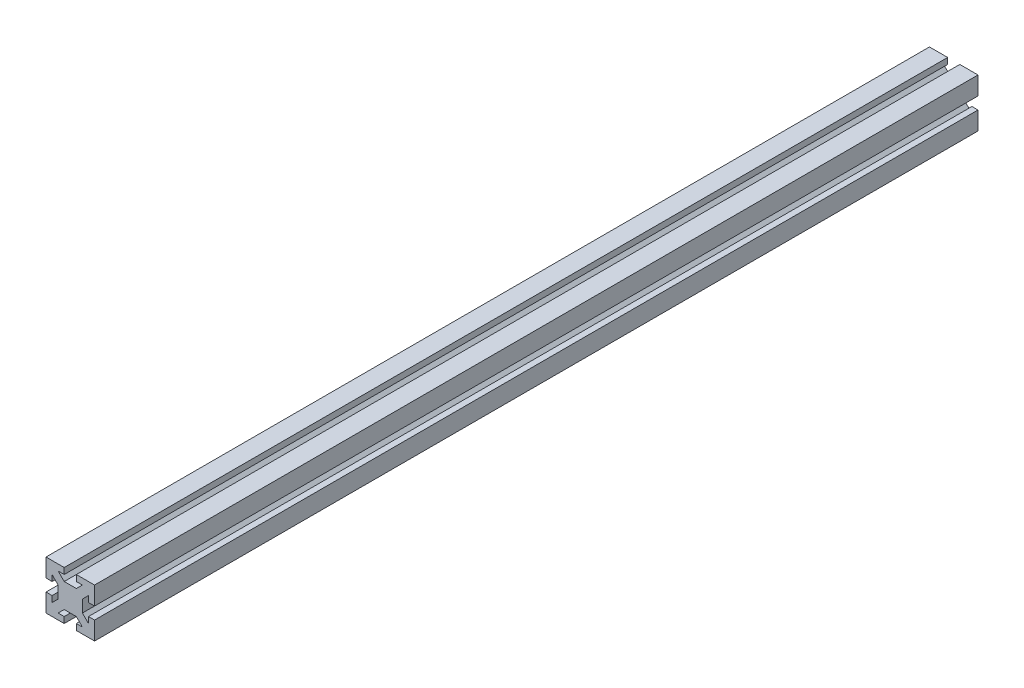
from build123d import *

# Parameters (mm, degrees)
BOSS_EXTRUDE1_DEPTH = 364


with BuildPart() as part:
    # Sketch1 → Boss-Extrude1 (new, symmetric)
    with BuildSketch(Plane.XY):
        Polygon((-5, 20), (-5, 15), (-10, 15), (-5, 10), (5, 10), (10, 15), (5, 15), (5, 20), (20, 20), (20, 5), (15, 5), (15, 10), (10, 5), (10, -5), (15, -10), (15, -5), (20, -5), (20, -20), (5, -20), (5, -15), (10, -15), (5, -10), (-5, -10), (-10, -15), (-5, -15), (-5, -20), (-20, -20), (-20, -5), (-15, -5), (-15, -10), (-10, -5), (-10, 5), (-15, 10), (-15, 5), (-20, 5), (-20, 20), align=None)
    extrude(amount=BOSS_EXTRUDE1_DEPTH, both=True)


solid = part.part
